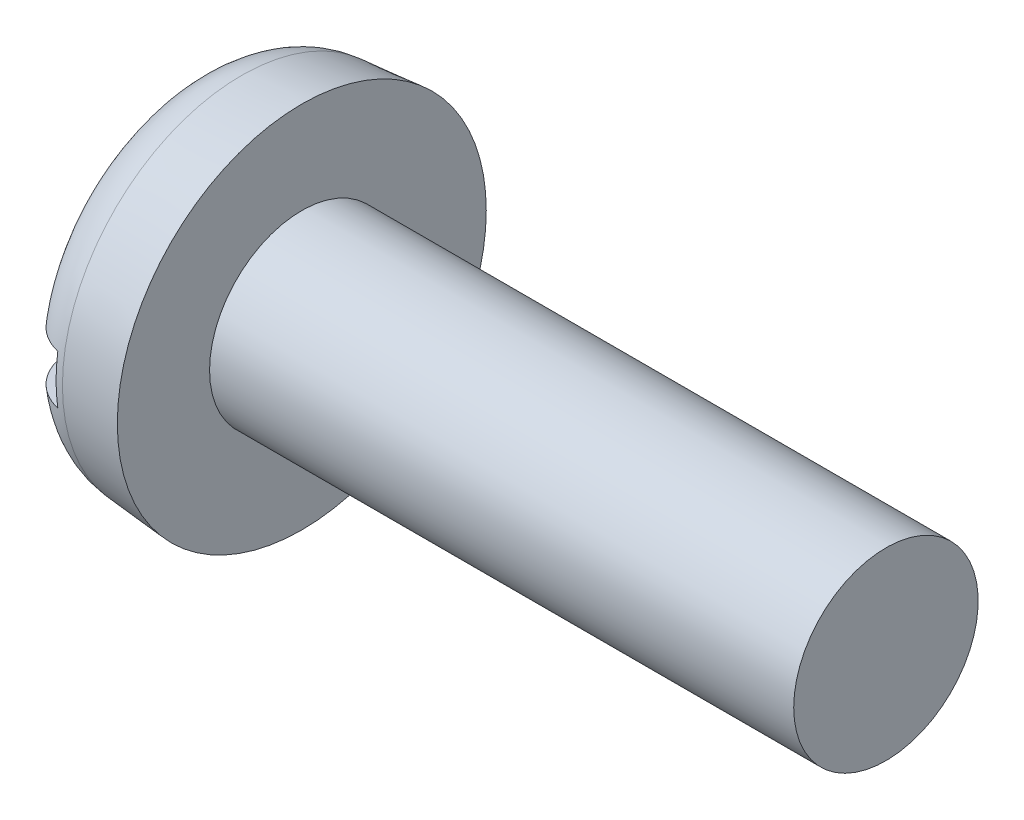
from build123d import *

# Parameters (mm, degrees)
FILLET2_R  = 1.8
SKETCH2_W  = 12
SKETCH2_H  = 1.6
SLOT_DEPTH = 1.4


with BuildPart() as part:
    # BodySke → Base-Revolve (revolve)
    with BuildSketch(Plane.XY, mode=Mode.PRIVATE) as base_revolve_sk:
        Polygon((3.6, 3), (3.6, 6), (0, 5.685040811), (0, 0), (22.6, 0), (22.6, 3), align=None)
    revolve(base_revolve_sk.sketch.rotate(Axis((-25.4, 0, 0), (1, 0, 0)), 90), axis=Axis((-25.4, 0, 0), (1, 0, 0)))

    # Fillet2
    fillet2_edges = [part.edges().sort_by_distance(p)[0] for p in [
        (0, 0, -5.685040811),
    ]]
    fillet(fillet2_edges, radius=FILLET2_R)

    # Sketch2 → Slot (cut)
    with BuildSketch(Plane(origin=(0, 0, 0), x_dir=(0, 0, -1), z_dir=(1, 0, 0))):
        Rectangle(SKETCH2_W, SKETCH2_H)
    extrude(amount=SLOT_DEPTH, mode=Mode.SUBTRACT)


solid = part.part
